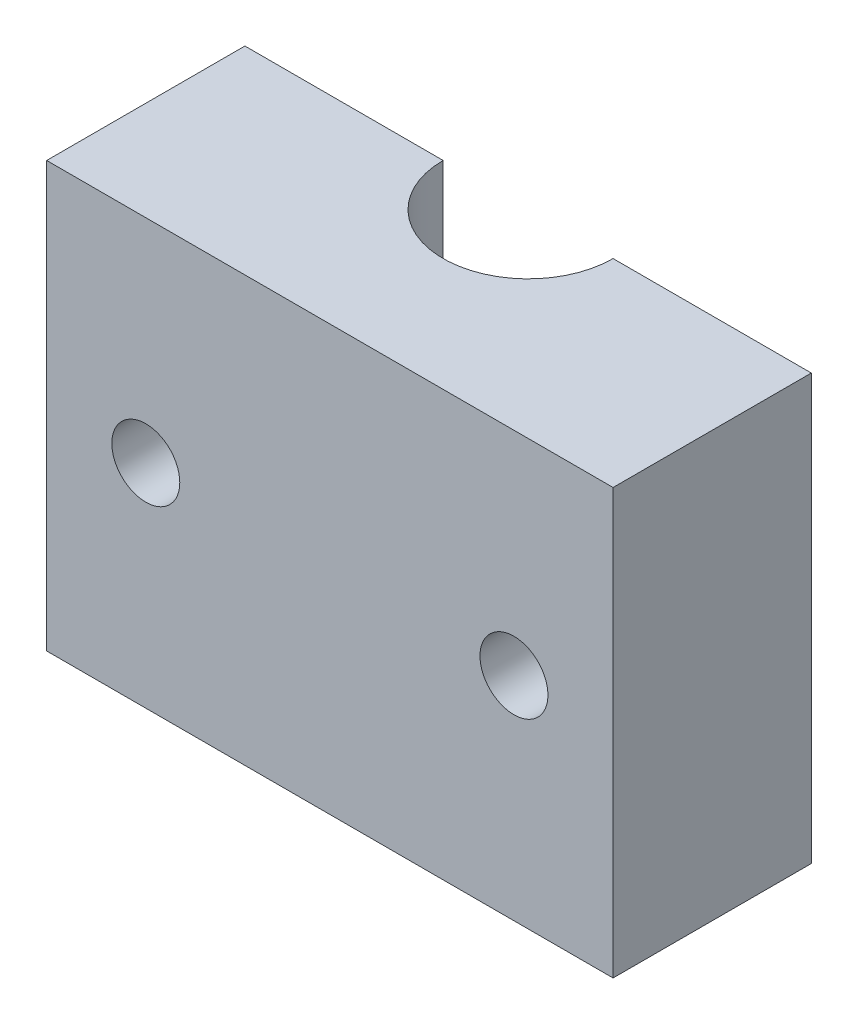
from build123d import *

# Parameters (mm, degrees)
SKETCH1_W          = 20
SKETCH1_H          = 15
EXTRUDE1_DEPTH     = 3.5
SKETCH2_R          = 3
CUT_EXTRUDE1_DEPTH = 19.364367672
SKETCH3_R          = 1.2
CUT_EXTRUDE2_DEPTH = 15.326548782


with BuildPart() as part:
    # Sketch1 → Extrude1 (new, symmetric)
    with BuildSketch(Plane.XY):
        Rectangle(SKETCH1_W, SKETCH1_H)
    extrude(amount=EXTRUDE1_DEPTH, both=True)

    # Sketch2 → Cut-Extrude1 (cut, through all)
    with BuildSketch(Plane(origin=(0, 7.5, 0), x_dir=(-1, 0, 0), z_dir=(0, 1, 0))):
        with Locations((0, -3.5)):
            Circle(SKETCH2_R)
    extrude(amount=-CUT_EXTRUDE1_DEPTH, mode=Mode.SUBTRACT)

    # Sketch3 → Cut-Extrude2 (cut, through all)
    with BuildSketch(Plane.XY.offset(3.5)):
        with Locations((-6.5, 0)):
            Circle(SKETCH3_R)
        with Locations((6.5, 0)):
            Circle(SKETCH3_R)
    extrude(amount=-CUT_EXTRUDE2_DEPTH, mode=Mode.SUBTRACT)


solid = part.part
